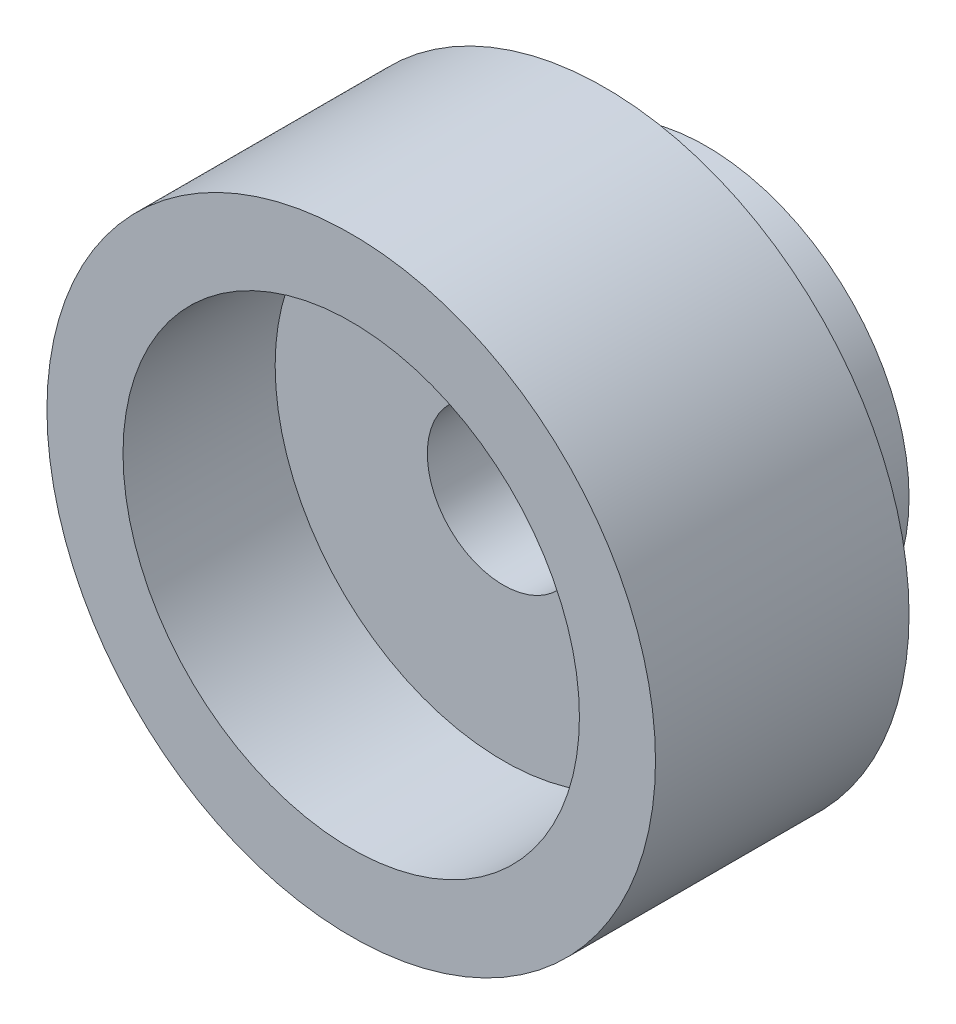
ISO-10303-21;
HEADER;
FILE_DESCRIPTION(('STEP AP214'),'2;1');
FILE_NAME('part.step','',(''),(''),'','','');
FILE_SCHEMA(('AUTOMOTIVE_DESIGN { 1 0 10303 214 1 1 1 1 }'));
ENDSEC;
DATA;
#1=APPLICATION_CONTEXT('core data for automotive mechanical design processes');
#2=APPLICATION_PROTOCOL_DEFINITION('international standard','automotive_design',2000,#1);
#3=PRODUCT_CONTEXT('',#1,'mechanical');
#4=PRODUCT('Part','Part','',(#3));
#5=PRODUCT_RELATED_PRODUCT_CATEGORY('part','',(#4));
#6=PRODUCT_DEFINITION_FORMATION('','',#4);
#7=PRODUCT_DEFINITION_CONTEXT('part definition',#1,'design');
#8=PRODUCT_DEFINITION('design','',#6,#7);
#9=PRODUCT_DEFINITION_SHAPE('','',#8);
#10=(LENGTH_UNIT() NAMED_UNIT(*) SI_UNIT(.MILLI.,.METRE.));
#11=(NAMED_UNIT(*) PLANE_ANGLE_UNIT() SI_UNIT($,.RADIAN.));
#12=(NAMED_UNIT(*) SI_UNIT($,.STERADIAN.) SOLID_ANGLE_UNIT());
#13=UNCERTAINTY_MEASURE_WITH_UNIT(LENGTH_MEASURE(1.E-05),#10,'distance_accuracy_value','');
#14=(GEOMETRIC_REPRESENTATION_CONTEXT(3) GLOBAL_UNCERTAINTY_ASSIGNED_CONTEXT((#13)) GLOBAL_UNIT_ASSIGNED_CONTEXT((#10,
#11,#12)) REPRESENTATION_CONTEXT('',''));
#15=CARTESIAN_POINT('',(0.,0.,0.));
#16=DIRECTION('',(0.,0.,1.));
#17=DIRECTION('',(1.,0.,0.));
#18=AXIS2_PLACEMENT_3D('',#15,#16,#17);
#19=CARTESIAN_POINT('',(0.,0.,20.));
#20=DIRECTION('',(0.,0.,1.));
#21=DIRECTION('',(1.,0.,0.));
#22=AXIS2_PLACEMENT_3D('',#19,#20,#21);
#23=CYLINDRICAL_SURFACE('',#22,8.);
#24=CARTESIAN_POINT('',(0.,0.,0.));
#25=DIRECTION('',(0.,0.,1.));
#26=DIRECTION('',(1.,0.,0.));
#27=AXIS2_PLACEMENT_3D('',#24,#25,#26);
#28=CIRCLE('',#27,8.);
#29=CARTESIAN_POINT('',(8.,0.,0.));
#30=VERTEX_POINT('',#29);
#31=EDGE_CURVE('E8',#30,#30,#28,.T.);
#32=ORIENTED_EDGE('',*,*,#31,.T.);
#33=EDGE_LOOP('',(#32));
#34=FACE_BOUND('',#33,.T.);
#35=CARTESIAN_POINT('',(0.,0.,4.));
#36=DIRECTION('',(0.,0.,1.));
#37=DIRECTION('',(1.,0.,0.));
#38=AXIS2_PLACEMENT_3D('',#35,#36,#37);
#39=CIRCLE('',#38,8.);
#40=CARTESIAN_POINT('',(8.,0.,4.));
#41=VERTEX_POINT('',#40);
#42=EDGE_CURVE('E25',#41,#41,#39,.T.);
#43=ORIENTED_EDGE('',*,*,#42,.F.);
#44=EDGE_LOOP('',(#43));
#45=FACE_BOUND('',#44,.T.);
#46=CARTESIAN_POINT('',(0.,8.,1.8));
#47=CARTESIAN_POINT('',(-0.0392387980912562,7.99999960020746,1.80000171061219));
#48=CARTESIAN_POINT('',(-0.0785041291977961,7.99970823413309,1.80331042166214));
#49=CARTESIAN_POINT('',(-0.155947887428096,7.99857393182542,1.81646051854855));
#50=CARTESIAN_POINT('',(-0.19412504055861,7.99773037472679,1.82630925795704));
#51=CARTESIAN_POINT('',(-0.268259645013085,7.99558699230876,1.85225197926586));
#52=CARTESIAN_POINT('',(-0.304218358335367,7.99428742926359,1.86834237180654));
#53=CARTESIAN_POINT('',(-0.372916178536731,7.99137767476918,1.9063050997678));
#54=CARTESIAN_POINT('',(-0.405655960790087,7.98976754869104,1.92817621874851));
#55=CARTESIAN_POINT('',(-0.467086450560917,7.98641224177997,1.97714543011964));
#56=CARTESIAN_POINT('',(-0.495766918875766,7.9846667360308,2.00425634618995));
#57=CARTESIAN_POINT('',(-0.548176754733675,7.98124011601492,2.06290840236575));
#58=CARTESIAN_POINT('',(-0.571905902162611,7.97955900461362,2.09444973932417));
#59=CARTESIAN_POINT('',(-0.61377460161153,7.97644806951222,2.16112985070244));
#60=CARTESIAN_POINT('',(-0.631905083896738,7.97501865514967,2.19627434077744));
#61=CARTESIAN_POINT('',(-0.662003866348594,7.97257676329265,2.26912335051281));
#62=CARTESIAN_POINT('',(-0.673972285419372,7.97156427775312,2.30682782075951));
#63=CARTESIAN_POINT('',(-0.691377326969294,7.97007366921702,2.38362340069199));
#64=CARTESIAN_POINT('',(-0.696830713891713,7.96959417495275,2.42271068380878));
#65=CARTESIAN_POINT('',(-0.701102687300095,7.96921952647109,2.5012484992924));
#66=CARTESIAN_POINT('',(-0.699921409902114,7.96932436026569,2.54069902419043));
#67=CARTESIAN_POINT('',(-0.690971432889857,7.97010527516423,2.61872842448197));
#68=CARTESIAN_POINT('',(-0.68322097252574,7.97077977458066,2.65730940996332));
#69=CARTESIAN_POINT('',(-0.661380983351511,7.97262154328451,2.73262081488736));
#70=CARTESIAN_POINT('',(-0.647291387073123,7.9737888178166,2.76935121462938));
#71=CARTESIAN_POINT('',(-0.613152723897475,7.97648643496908,2.83997681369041));
#72=CARTESIAN_POINT('',(-0.593095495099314,7.97801727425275,2.87386804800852));
#73=CARTESIAN_POINT('',(-0.547596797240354,7.98126908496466,2.9378099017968));
#74=CARTESIAN_POINT('',(-0.52215520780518,7.98299006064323,2.96786043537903));
#75=CARTESIAN_POINT('',(-0.466507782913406,7.98643527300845,3.02337390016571));
#76=CARTESIAN_POINT('',(-0.4362861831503,7.98815950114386,3.04882103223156));
#77=CARTESIAN_POINT('',(-0.371991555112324,7.99141142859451,3.09428311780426));
#78=CARTESIAN_POINT('',(-0.337918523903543,7.99293912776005,3.114298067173));
#79=CARTESIAN_POINT('',(-0.266877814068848,7.99562620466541,3.14832673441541));
#80=CARTESIAN_POINT('',(-0.229909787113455,7.99678553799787,3.16233972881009));
#81=CARTESIAN_POINT('',(-0.154133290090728,7.99860476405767,3.18395552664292));
#82=CARTESIAN_POINT('',(-0.115324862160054,7.99926466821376,3.19155847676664));
#83=CARTESIAN_POINT('',(-0.0371061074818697,8.0000092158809,3.20011850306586));
#84=CARTESIAN_POINT('',(0.00230181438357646,8.00009574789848,3.20109739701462));
#85=CARTESIAN_POINT('',(0.0807211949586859,7.99968885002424,3.19643871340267));
#86=CARTESIAN_POINT('',(0.119732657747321,7.99919542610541,3.1908012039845));
#87=CARTESIAN_POINT('',(0.196189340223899,7.99768531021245,3.1730878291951));
#88=CARTESIAN_POINT('',(0.233636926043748,7.9966694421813,3.16102210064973));
#89=CARTESIAN_POINT('',(0.305976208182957,7.99422852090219,3.13080515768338));
#90=CARTESIAN_POINT('',(0.340867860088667,7.99280346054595,3.11265383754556));
#91=CARTESIAN_POINT('',(0.407203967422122,7.989699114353,3.07072630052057));
#92=CARTESIAN_POINT('',(0.438639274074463,7.98801918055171,3.04693565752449));
#93=CARTESIAN_POINT('',(0.497077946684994,7.98459592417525,2.99442560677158));
#94=CARTESIAN_POINT('',(0.524081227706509,7.98285260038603,2.96570610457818));
#95=CARTESIAN_POINT('',(0.572964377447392,7.97949343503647,2.90405877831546));
#96=CARTESIAN_POINT('',(0.594829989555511,7.97787795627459,2.87111962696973));
#97=CARTESIAN_POINT('',(0.632719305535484,7.97496262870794,2.80202428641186));
#98=CARTESIAN_POINT('',(0.648743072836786,7.97366277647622,2.76586813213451));
#99=CARTESIAN_POINT('',(0.674469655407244,7.97152797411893,2.69141523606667));
#100=CARTESIAN_POINT('',(0.684181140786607,7.97069238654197,2.65312150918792));
#101=CARTESIAN_POINT('',(0.697035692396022,7.96957862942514,2.5754393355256));
#102=CARTESIAN_POINT('',(0.700178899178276,7.96930044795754,2.53605091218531));
#103=CARTESIAN_POINT('',(0.699805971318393,7.96933319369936,2.45743912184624));
#104=CARTESIAN_POINT('',(0.696312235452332,7.96964213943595,2.41821564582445));
#105=CARTESIAN_POINT('',(0.682811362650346,7.97081011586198,2.34091488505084));
#106=CARTESIAN_POINT('',(0.67280421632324,7.97166914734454,2.30283760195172));
#107=CARTESIAN_POINT('',(0.646566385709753,7.97383997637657,2.22890903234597));
#108=CARTESIAN_POINT('',(0.630336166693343,7.97515174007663,2.19305757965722));
#109=CARTESIAN_POINT('',(0.592115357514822,7.97808029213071,2.12458454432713));
#110=CARTESIAN_POINT('',(0.570124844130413,7.97969707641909,2.09196291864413));
#111=CARTESIAN_POINT('',(0.520923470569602,7.98306000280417,2.03076084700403));
#112=CARTESIAN_POINT('',(0.493695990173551,7.98480654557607,2.00219378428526));
#113=CARTESIAN_POINT('',(0.434824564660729,7.98822853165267,1.95002304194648));
#114=CARTESIAN_POINT('',(0.403179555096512,7.98990395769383,1.92642056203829));
#115=CARTESIAN_POINT('',(0.33630437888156,7.99299826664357,1.88481389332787));
#116=CARTESIAN_POINT('',(0.301067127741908,7.99441662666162,1.86682106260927));
#117=CARTESIAN_POINT('',(0.22808290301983,7.99683098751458,1.83703070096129));
#118=CARTESIAN_POINT('',(0.190338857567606,7.99782747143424,1.82522608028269));
#119=CARTESIAN_POINT('',(0.126978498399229,7.99903125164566,1.81113902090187));
#120=CARTESIAN_POINT('',(0.101769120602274,7.99939286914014,1.80696747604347));
#121=CARTESIAN_POINT('',(0.0510435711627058,7.9998773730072,1.80139741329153));
#122=CARTESIAN_POINT('',(0.0255274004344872,8.00000026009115,1.79999888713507));
#123=CARTESIAN_POINT('',(0.,8.,1.8));
#124=B_SPLINE_CURVE_WITH_KNOTS('',3,(#46,#47,#48,#49,#50,#51,#52,#53,#54,#55,#56,#57,#58,#59,
#60,#61,#62,#63,#64,#65,#66,#67,#68,#69,#70,#71,#72,#73,#74,#75,#76,#77,#78,#79,#80,#81,#82,#83,
#84,#85,#86,#87,#88,#89,#90,#91,#92,#93,#94,#95,#96,#97,#98,#99,#100,#101,#102,#103,#104,#105,
#106,#107,#108,#109,#110,#111,#112,#113,#114,#115,#116,#117,#118,#119,#120,#121,#122,#123),
.UNSPECIFIED.,.T.,.F.,(4,2,2,2,2,2,2,2,2,2,2,2,2,2,2,2,2,2,2,2,2,2,2,2,2,2,2,2,2,2,2,2,2,2,2,2,
2,2,4),(0.,0.117623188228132,0.235378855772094,0.353066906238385,0.470730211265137,
0.588685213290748,0.70664545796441,0.824795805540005,0.942943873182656,1.06078726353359,
1.17862823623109,1.29614309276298,1.41365920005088,1.53133677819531,1.64901698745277,
1.7670937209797,1.88517054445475,2.00326159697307,2.12134994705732,2.23904915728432,
2.35674715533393,2.47426009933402,2.59177508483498,2.70959399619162,2.82741516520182,
2.94555951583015,3.06370258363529,3.18168303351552,3.29966095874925,3.41724143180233,
3.53482207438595,3.65239392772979,3.76996421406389,3.88791397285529,4.00589220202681,
4.12410777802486,4.24218761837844,4.31870941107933,4.39523097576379),.UNSPECIFIED.);
#125=CARTESIAN_POINT('',(0.,8.,1.8));
#126=VERTEX_POINT('',#125);
#127=EDGE_CURVE('E49',#126,#126,#124,.T.);
#128=ORIENTED_EDGE('',*,*,#127,.F.);
#129=EDGE_LOOP('',(#128));
#130=FACE_BOUND('',#129,.T.);
#131=ADVANCED_FACE('F12',(#34,#45,#130),#23,.T.);
#132=CARTESIAN_POINT('',(0.,0.,20.));
#133=DIRECTION('',(0.,0.,1.));
#134=DIRECTION('',(1.,0.,0.));
#135=AXIS2_PLACEMENT_3D('',#132,#133,#134);
#136=CYLINDRICAL_SURFACE('',#135,3.);
#137=CARTESIAN_POINT('',(0.,0.,0.));
#138=DIRECTION('',(0.,0.,1.));
#139=DIRECTION('',(1.,0.,0.));
#140=AXIS2_PLACEMENT_3D('',#137,#138,#139);
#141=CIRCLE('',#140,3.);
#142=CARTESIAN_POINT('',(3.,0.,0.));
#143=VERTEX_POINT('',#142);
#144=EDGE_CURVE('E46',#143,#143,#141,.T.);
#145=ORIENTED_EDGE('',*,*,#144,.F.);
#146=EDGE_LOOP('',(#145));
#147=FACE_BOUND('',#146,.T.);
#148=CARTESIAN_POINT('',(0.,0.,8.));
#149=DIRECTION('',(0.,0.,1.));
#150=DIRECTION('',(1.,0.,0.));
#151=AXIS2_PLACEMENT_3D('',#148,#149,#150);
#152=CIRCLE('',#151,3.);
#153=CARTESIAN_POINT('',(3.,0.,8.));
#154=VERTEX_POINT('',#153);
#155=EDGE_CURVE('E43',#154,#154,#152,.T.);
#156=ORIENTED_EDGE('',*,*,#155,.T.);
#157=EDGE_LOOP('',(#156));
#158=FACE_BOUND('',#157,.T.);
#159=CARTESIAN_POINT('',(0.,3.,1.8));
#160=CARTESIAN_POINT('',(-0.0387568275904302,2.99999930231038,1.80000122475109));
#161=CARTESIAN_POINT('',(-0.077527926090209,2.99924138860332,1.80322962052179));
#162=CARTESIAN_POINT('',(-0.153964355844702,2.99629122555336,1.81604183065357));
#163=CARTESIAN_POINT('',(-0.191628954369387,2.99409804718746,1.82562976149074));
#164=CARTESIAN_POINT('',(-0.264737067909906,2.98852094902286,1.85084084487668));
#165=CARTESIAN_POINT('',(-0.300183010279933,2.98513835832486,1.8664572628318));
#166=CARTESIAN_POINT('',(-0.367951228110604,2.9775453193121,1.90325958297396));
#167=CARTESIAN_POINT('',(-0.400273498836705,2.97333486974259,1.92444549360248));
#168=CARTESIAN_POINT('',(-0.461462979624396,2.96446022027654,1.97219117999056));
#169=CARTESIAN_POINT('',(-0.490265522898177,2.95978975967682,1.99883267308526));
#170=CARTESIAN_POINT('',(-0.543036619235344,2.95056443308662,2.05655805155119));
#171=CARTESIAN_POINT('',(-0.567004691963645,2.94600957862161,2.08764237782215));
#172=CARTESIAN_POINT('',(-0.609720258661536,2.93746885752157,2.15386000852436));
#173=CARTESIAN_POINT('',(-0.628397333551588,2.93349098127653,2.18903986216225));
#174=CARTESIAN_POINT('',(-0.65954851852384,2.92664515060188,2.26214734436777));
#175=CARTESIAN_POINT('',(-0.672023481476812,2.92377704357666,2.30007459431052));
#176=CARTESIAN_POINT('',(-0.690199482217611,2.91953953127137,2.37689430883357));
#177=CARTESIAN_POINT('',(-0.696015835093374,2.91814464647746,2.41575805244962));
#178=CARTESIAN_POINT('',(-0.701068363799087,2.91693510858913,2.49393280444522));
#179=CARTESIAN_POINT('',(-0.700305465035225,2.91712023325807,2.53324374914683));
#180=CARTESIAN_POINT('',(-0.692313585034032,2.91902680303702,2.61032794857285));
#181=CARTESIAN_POINT('',(-0.685220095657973,2.92071605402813,2.64811616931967));
#182=CARTESIAN_POINT('',(-0.664983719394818,2.9253894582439,2.72195092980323));
#183=CARTESIAN_POINT('',(-0.651840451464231,2.92837369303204,2.75799735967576));
#184=CARTESIAN_POINT('',(-0.619757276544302,2.93533155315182,2.82769824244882));
#185=CARTESIAN_POINT('',(-0.600766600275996,2.93931378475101,2.86132843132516));
#186=CARTESIAN_POINT('',(-0.557563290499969,2.94781385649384,2.92497422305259));
#187=CARTESIAN_POINT('',(-0.533349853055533,2.95233177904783,2.95498926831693));
#188=CARTESIAN_POINT('',(-0.47967806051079,2.96153115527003,3.01133124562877));
#189=CARTESIAN_POINT('',(-0.450104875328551,2.96621389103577,3.0375487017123));
#190=CARTESIAN_POINT('',(-0.38692699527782,2.97511404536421,3.08467126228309));
#191=CARTESIAN_POINT('',(-0.353322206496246,2.97933145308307,3.10557624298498));
#192=CARTESIAN_POINT('',(-0.282891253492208,2.98684256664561,3.14151334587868));
#193=CARTESIAN_POINT('',(-0.246056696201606,2.99013376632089,3.1565295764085));
#194=CARTESIAN_POINT('',(-0.170292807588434,2.99540322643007,3.18012785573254));
#195=CARTESIAN_POINT('',(-0.131363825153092,2.99738170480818,3.18871097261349));
#196=CARTESIAN_POINT('',(-0.0534537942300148,2.99977122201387,3.1990365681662));
#197=CARTESIAN_POINT('',(-0.0144935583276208,3.00021647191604,3.20092837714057));
#198=CARTESIAN_POINT('',(0.0631864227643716,2.99958594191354,3.19822458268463));
#199=CARTESIAN_POINT('',(0.101906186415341,2.99851028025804,3.1936294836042));
#200=CARTESIAN_POINT('',(0.177500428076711,2.99498053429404,3.17820584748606));
#201=CARTESIAN_POINT('',(0.214392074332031,2.9925440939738,3.16745705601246));
#202=CARTESIAN_POINT('',(0.285847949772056,2.98656620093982,3.14012082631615));
#203=CARTESIAN_POINT('',(0.320411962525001,2.98302464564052,3.12353284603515));
#204=CARTESIAN_POINT('',(0.38683843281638,2.97514597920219,3.08468784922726));
#205=CARTESIAN_POINT('',(0.418649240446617,2.9707971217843,3.06234494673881));
#206=CARTESIAN_POINT('',(0.478123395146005,2.96180760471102,3.01273590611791));
#207=CARTESIAN_POINT('',(0.505786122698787,2.95716690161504,2.98546903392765));
#208=CARTESIAN_POINT('',(0.556780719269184,2.94799626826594,2.92609685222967));
#209=CARTESIAN_POINT('',(0.580008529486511,2.9434707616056,2.89390134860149));
#210=CARTESIAN_POINT('',(0.620729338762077,2.93515395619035,2.82597959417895));
#211=CARTESIAN_POINT('',(0.638222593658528,2.93136262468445,2.7902535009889));
#212=CARTESIAN_POINT('',(0.666852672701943,2.92498252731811,2.71647977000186));
#213=CARTESIAN_POINT('',(0.678026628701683,2.92238675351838,2.67844717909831));
#214=CARTESIAN_POINT('',(0.693805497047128,2.91868135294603,2.60097475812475));
#215=CARTESIAN_POINT('',(0.698411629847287,2.91757145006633,2.56153519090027));
#216=CARTESIAN_POINT('',(0.700866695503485,2.9169825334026,2.48342172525));
#217=CARTESIAN_POINT('',(0.698881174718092,2.91746356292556,2.44475324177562));
#218=CARTESIAN_POINT('',(0.68858335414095,2.91991103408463,2.36831848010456));
#219=CARTESIAN_POINT('',(0.68027115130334,2.92187745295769,2.33055218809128));
#220=CARTESIAN_POINT('',(0.657640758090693,2.92705336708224,2.25714725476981));
#221=CARTESIAN_POINT('',(0.643349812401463,2.93025721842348,2.22149978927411));
#222=CARTESIAN_POINT('',(0.609189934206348,2.93754852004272,2.1530850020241));
#223=CARTESIAN_POINT('',(0.589320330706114,2.94163607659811,2.12031802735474));
#224=CARTESIAN_POINT('',(0.544031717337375,2.95035113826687,2.05778544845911));
#225=CARTESIAN_POINT('',(0.518496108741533,2.9549888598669,2.02810569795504));
#226=CARTESIAN_POINT('',(0.4628326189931,2.96421665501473,1.97339846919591));
#227=CARTESIAN_POINT('',(0.432703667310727,2.96880671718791,1.94837207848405));
#228=CARTESIAN_POINT('',(0.368155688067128,2.97750512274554,1.90331409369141));
#229=CARTESIAN_POINT('',(0.333678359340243,2.98160507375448,1.88336429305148));
#230=CARTESIAN_POINT('',(0.261769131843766,2.98877534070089,1.84957521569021));
#231=CARTESIAN_POINT('',(0.22433957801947,2.99184646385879,1.83573114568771));
#232=CARTESIAN_POINT('',(0.155764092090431,2.99610696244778,1.81682989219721));
#233=CARTESIAN_POINT('',(0.124970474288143,2.99755737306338,1.81053142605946));
#234=CARTESIAN_POINT('',(0.0627876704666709,2.99950414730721,1.80211610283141));
#235=CARTESIAN_POINT('',(0.0313985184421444,3.00000056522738,1.79999900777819));
#236=CARTESIAN_POINT('',(0.,3.,1.8));
#237=B_SPLINE_CURVE_WITH_KNOTS('',3,(#159,#160,#161,#162,#163,#164,#165,#166,#167,#168,#169,
#170,#171,#172,#173,#174,#175,#176,#177,#178,#179,#180,#181,#182,#183,#184,#185,#186,#187,#188,
#189,#190,#191,#192,#193,#194,#195,#196,#197,#198,#199,#200,#201,#202,#203,#204,#205,#206,#207,
#208,#209,#210,#211,#212,#213,#214,#215,#216,#217,#218,#219,#220,#221,#222,#223,#224,#225,#226,
#227,#228,#229,#230,#231,#232,#233,#234,#235,#236),.UNSPECIFIED.,.T.,.F.,(4,2,2,2,2,2,2,2,2,2,2,
2,2,2,2,2,2,2,2,2,2,2,2,2,2,2,2,2,2,2,2,2,2,2,2,2,2,2,4),(0.,0.116155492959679,
0.232386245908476,0.348487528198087,0.464588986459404,0.582576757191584,0.700576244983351,
0.82007942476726,0.939566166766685,1.05695072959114,1.17431878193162,1.28923352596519,
1.4041555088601,1.52010484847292,1.63607204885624,1.75490515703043,1.87374103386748,
1.99289543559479,2.11203004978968,2.22848854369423,2.34493798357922,2.45991145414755,
2.57489560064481,2.69170669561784,2.80853521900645,2.92783651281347,3.04713248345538,
3.16571999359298,3.2842854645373,3.39989596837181,3.51550470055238,3.6305922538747,
3.74569365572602,3.86342932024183,3.9811924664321,4.10074746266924,4.22020843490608,
4.31431618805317,4.40841858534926),.UNSPECIFIED.);
#238=CARTESIAN_POINT('',(0.,3.,1.8));
#239=VERTEX_POINT('',#238);
#240=EDGE_CURVE('E16',#239,#239,#237,.T.);
#241=ORIENTED_EDGE('',*,*,#240,.T.);
#242=EDGE_LOOP('',(#241));
#243=FACE_BOUND('',#242,.T.);
#244=ADVANCED_FACE('F61',(#147,#158,#243),#136,.F.);
#245=CARTESIAN_POINT('',(-3.,0.,0.));
#246=DIRECTION('',(0.,0.,1.));
#247=DIRECTION('',(1.,0.,0.));
#248=AXIS2_PLACEMENT_3D('',#245,#246,#247);
#249=PLANE('',#248);
#250=ORIENTED_EDGE('',*,*,#31,.F.);
#251=EDGE_LOOP('',(#250));
#252=FACE_BOUND('',#251,.T.);
#253=ORIENTED_EDGE('',*,*,#144,.T.);
#254=EDGE_LOOP('',(#253));
#255=FACE_BOUND('',#254,.T.);
#256=ADVANCED_FACE('F14',(#252,#255),#249,.F.);
#257=CARTESIAN_POINT('',(-8.,0.,4.));
#258=DIRECTION('',(0.,0.,1.));
#259=DIRECTION('',(1.,0.,0.));
#260=AXIS2_PLACEMENT_3D('',#257,#258,#259);
#261=PLANE('',#260);
#262=CARTESIAN_POINT('',(0.,0.,4.));
#263=DIRECTION('',(0.,0.,1.));
#264=DIRECTION('',(1.,0.,0.));
#265=AXIS2_PLACEMENT_3D('',#262,#263,#264);
#266=CIRCLE('',#265,12.);
#267=CARTESIAN_POINT('',(12.,0.,4.));
#268=VERTEX_POINT('',#267);
#269=EDGE_CURVE('E29',#268,#268,#266,.T.);
#270=ORIENTED_EDGE('',*,*,#269,.F.);
#271=EDGE_LOOP('',(#270));
#272=FACE_BOUND('',#271,.T.);
#273=ORIENTED_EDGE('',*,*,#42,.T.);
#274=EDGE_LOOP('',(#273));
#275=FACE_BOUND('',#274,.T.);
#276=ADVANCED_FACE('F80',(#272,#275),#261,.F.);
#277=CARTESIAN_POINT('',(0.,0.,20.));
#278=DIRECTION('',(0.,0.,1.));
#279=DIRECTION('',(1.,0.,0.));
#280=AXIS2_PLACEMENT_3D('',#277,#278,#279);
#281=CYLINDRICAL_SURFACE('',#280,12.);
#282=ORIENTED_EDGE('',*,*,#269,.T.);
#283=EDGE_LOOP('',(#282));
#284=FACE_BOUND('',#283,.T.);
#285=CARTESIAN_POINT('',(0.,0.,14.));
#286=DIRECTION('',(0.,0.,1.));
#287=DIRECTION('',(1.,0.,0.));
#288=AXIS2_PLACEMENT_3D('',#285,#286,#287);
#289=CIRCLE('',#288,12.);
#290=CARTESIAN_POINT('',(12.,0.,14.));
#291=VERTEX_POINT('',#290);
#292=EDGE_CURVE('E34',#291,#291,#289,.T.);
#293=ORIENTED_EDGE('',*,*,#292,.F.);
#294=EDGE_LOOP('',(#293));
#295=FACE_BOUND('',#294,.T.);
#296=ADVANCED_FACE('F77',(#284,#295),#281,.T.);
#297=CARTESIAN_POINT('',(-9.,0.,14.));
#298=DIRECTION('',(0.,0.,1.));
#299=DIRECTION('',(1.,0.,0.));
#300=AXIS2_PLACEMENT_3D('',#297,#298,#299);
#301=PLANE('',#300);
#302=ORIENTED_EDGE('',*,*,#292,.T.);
#303=EDGE_LOOP('',(#302));
#304=FACE_BOUND('',#303,.T.);
#305=CARTESIAN_POINT('',(0.,0.,14.));
#306=DIRECTION('',(0.,0.,1.));
#307=DIRECTION('',(1.,0.,0.));
#308=AXIS2_PLACEMENT_3D('',#305,#306,#307);
#309=CIRCLE('',#308,9.);
#310=CARTESIAN_POINT('',(9.,0.,14.));
#311=VERTEX_POINT('',#310);
#312=EDGE_CURVE('E37',#311,#311,#309,.T.);
#313=ORIENTED_EDGE('',*,*,#312,.F.);
#314=EDGE_LOOP('',(#313));
#315=FACE_BOUND('',#314,.T.);
#316=ADVANCED_FACE('F73',(#304,#315),#301,.T.);
#317=CARTESIAN_POINT('',(0.,0.,20.));
#318=DIRECTION('',(0.,0.,1.));
#319=DIRECTION('',(1.,0.,0.));
#320=AXIS2_PLACEMENT_3D('',#317,#318,#319);
#321=CYLINDRICAL_SURFACE('',#320,9.);
#322=ORIENTED_EDGE('',*,*,#312,.T.);
#323=EDGE_LOOP('',(#322));
#324=FACE_BOUND('',#323,.T.);
#325=CARTESIAN_POINT('',(0.,0.,8.));
#326=DIRECTION('',(0.,0.,1.));
#327=DIRECTION('',(1.,0.,0.));
#328=AXIS2_PLACEMENT_3D('',#325,#326,#327);
#329=CIRCLE('',#328,9.);
#330=CARTESIAN_POINT('',(9.,0.,8.));
#331=VERTEX_POINT('',#330);
#332=EDGE_CURVE('E40',#331,#331,#329,.T.);
#333=ORIENTED_EDGE('',*,*,#332,.F.);
#334=EDGE_LOOP('',(#333));
#335=FACE_BOUND('',#334,.T.);
#336=ADVANCED_FACE('F69',(#324,#335),#321,.F.);
#337=CARTESIAN_POINT('',(-3.,0.,8.));
#338=DIRECTION('',(0.,0.,1.));
#339=DIRECTION('',(1.,0.,0.));
#340=AXIS2_PLACEMENT_3D('',#337,#338,#339);
#341=PLANE('',#340);
#342=ORIENTED_EDGE('',*,*,#332,.T.);
#343=EDGE_LOOP('',(#342));
#344=FACE_BOUND('',#343,.T.);
#345=ORIENTED_EDGE('',*,*,#155,.F.);
#346=EDGE_LOOP('',(#345));
#347=FACE_BOUND('',#346,.T.);
#348=ADVANCED_FACE('F59',(#344,#347),#341,.T.);
#349=CARTESIAN_POINT('',(0.,10.,2.5));
#350=DIRECTION('',(0.,-1.,0.));
#351=DIRECTION('',(0.,0.,-1.));
#352=AXIS2_PLACEMENT_3D('',#349,#350,#351);
#353=CYLINDRICAL_SURFACE('',#352,0.7);
#354=ORIENTED_EDGE('',*,*,#240,.F.);
#355=EDGE_LOOP('',(#354));
#356=FACE_BOUND('',#355,.T.);
#357=ORIENTED_EDGE('',*,*,#127,.T.);
#358=EDGE_LOOP('',(#357));
#359=FACE_BOUND('',#358,.T.);
#360=ADVANCED_FACE('F56',(#356,#359),#353,.F.);
#361=CLOSED_SHELL('',(#131,#244,#256,#276,#296,#316,#336,#348,#360));
#362=MANIFOLD_SOLID_BREP('B1',#361);
#363=ADVANCED_BREP_SHAPE_REPRESENTATION('',(#18,#362),#14);
#364=SHAPE_DEFINITION_REPRESENTATION(#9,#363);
ENDSEC;
END-ISO-10303-21;
